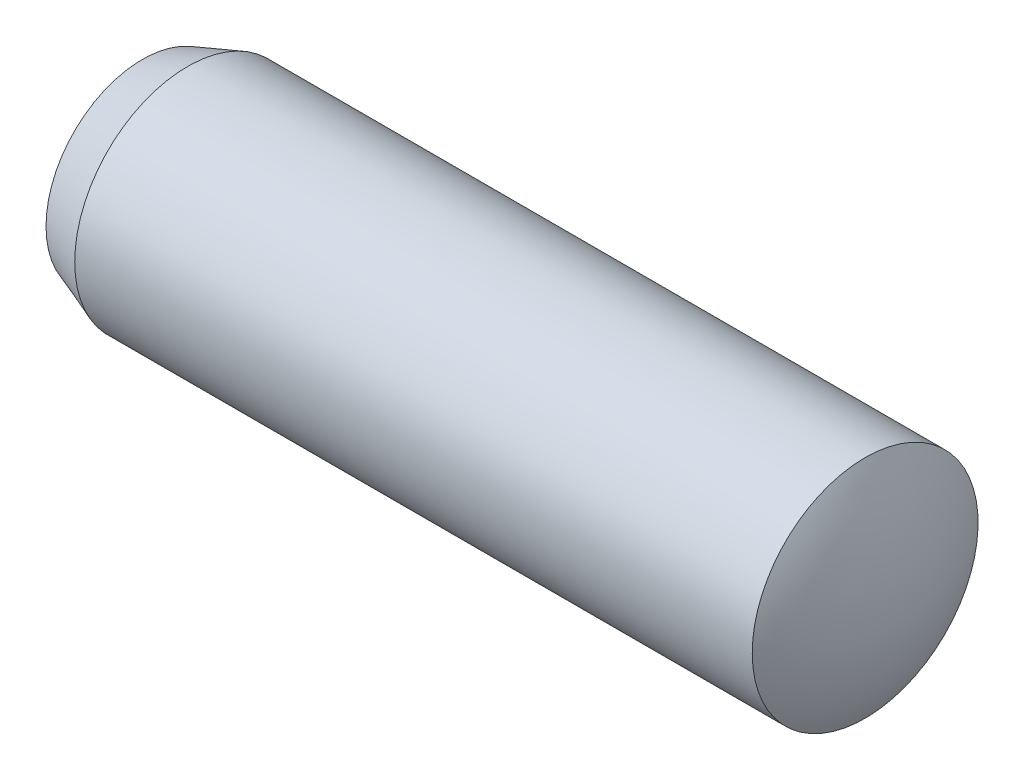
ISO-10303-21;
HEADER;
FILE_DESCRIPTION(('STEP AP214'),'2;1');
FILE_NAME('part.step','',(''),(''),'','','');
FILE_SCHEMA(('AUTOMOTIVE_DESIGN { 1 0 10303 214 1 1 1 1 }'));
ENDSEC;
DATA;
#1=APPLICATION_CONTEXT('core data for automotive mechanical design processes');
#2=APPLICATION_PROTOCOL_DEFINITION('international standard','automotive_design',2000,#1);
#3=PRODUCT_CONTEXT('',#1,'mechanical');
#4=PRODUCT('Part','Part','',(#3));
#5=PRODUCT_RELATED_PRODUCT_CATEGORY('part','',(#4));
#6=PRODUCT_DEFINITION_FORMATION('','',#4);
#7=PRODUCT_DEFINITION_CONTEXT('part definition',#1,'design');
#8=PRODUCT_DEFINITION('design','',#6,#7);
#9=PRODUCT_DEFINITION_SHAPE('','',#8);
#10=(LENGTH_UNIT() NAMED_UNIT(*) SI_UNIT(.MILLI.,.METRE.));
#11=(NAMED_UNIT(*) PLANE_ANGLE_UNIT() SI_UNIT($,.RADIAN.));
#12=(NAMED_UNIT(*) SI_UNIT($,.STERADIAN.) SOLID_ANGLE_UNIT());
#13=UNCERTAINTY_MEASURE_WITH_UNIT(LENGTH_MEASURE(1.E-05),#10,'distance_accuracy_value','');
#14=(GEOMETRIC_REPRESENTATION_CONTEXT(3) GLOBAL_UNCERTAINTY_ASSIGNED_CONTEXT((#13)) GLOBAL_UNIT_ASSIGNED_CONTEXT((#10,
#11,#12)) REPRESENTATION_CONTEXT('',''));
#15=CARTESIAN_POINT('',(0.,0.,0.));
#16=DIRECTION('',(0.,0.,1.));
#17=DIRECTION('',(1.,0.,0.));
#18=AXIS2_PLACEMENT_3D('',#15,#16,#17);
#19=CARTESIAN_POINT('',(0.,0.,0.));
#20=DIRECTION('',(-1.,0.,0.));
#21=DIRECTION('',(0.,0.,1.));
#22=AXIS2_PLACEMENT_3D('',#19,#20,#21);
#23=PLANE('',#22);
#24=CARTESIAN_POINT('',(0.,0.,0.));
#25=DIRECTION('',(-1.,0.,0.));
#26=DIRECTION('',(0.,0.,1.));
#27=AXIS2_PLACEMENT_3D('',#24,#25,#26);
#28=CIRCLE('',#27,2.56323571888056);
#29=CARTESIAN_POINT('',(0.,0.,2.56323571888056));
#30=VERTEX_POINT('',#29);
#31=EDGE_CURVE('E10',#30,#30,#28,.T.);
#32=ORIENTED_EDGE('',*,*,#31,.T.);
#33=EDGE_LOOP('',(#32));
#34=FACE_BOUND('',#33,.T.);
#35=ADVANCED_FACE('F27',(#34),#23,.T.);
#36=CARTESIAN_POINT('',(0.,0.,0.));
#37=DIRECTION('',(1.,0.,0.));
#38=DIRECTION('',(0.,0.,-1.));
#39=AXIS2_PLACEMENT_3D('',#36,#37,#38);
#40=CONICAL_SURFACE('',#39,2.56323571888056,0.349065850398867);
#41=CARTESIAN_POINT('',(1.20000000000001,0.,0.));
#42=DIRECTION('',(-1.,0.,0.));
#43=DIRECTION('',(0.,0.,1.));
#44=AXIS2_PLACEMENT_3D('',#41,#42,#43);
#45=CIRCLE('',#44,3.);
#46=CARTESIAN_POINT('',(1.20000000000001,0.,3.));
#47=VERTEX_POINT('',#46);
#48=EDGE_CURVE('E33',#47,#47,#45,.T.);
#49=ORIENTED_EDGE('',*,*,#48,.T.);
#50=EDGE_LOOP('',(#49));
#51=FACE_BOUND('',#50,.T.);
#52=ORIENTED_EDGE('',*,*,#31,.F.);
#53=EDGE_LOOP('',(#52));
#54=FACE_BOUND('',#53,.T.);
#55=ADVANCED_FACE('F53',(#51,#54),#40,.T.);
#56=CARTESIAN_POINT('',(0.,0.,0.));
#57=DIRECTION('',(-1.,0.,0.));
#58=DIRECTION('',(0.,0.,1.));
#59=AXIS2_PLACEMENT_3D('',#56,#57,#58);
#60=CYLINDRICAL_SURFACE('',#59,3.);
#61=CARTESIAN_POINT('',(19.2,0.,0.));
#62=DIRECTION('',(-1.,0.,0.));
#63=DIRECTION('',(0.,0.,1.));
#64=AXIS2_PLACEMENT_3D('',#61,#62,#63);
#65=CIRCLE('',#64,3.);
#66=CARTESIAN_POINT('',(19.2,0.,3.));
#67=VERTEX_POINT('',#66);
#68=EDGE_CURVE('E37',#67,#67,#65,.T.);
#69=ORIENTED_EDGE('',*,*,#68,.T.);
#70=EDGE_LOOP('',(#69));
#71=FACE_BOUND('',#70,.T.);
#72=ORIENTED_EDGE('',*,*,#48,.F.);
#73=EDGE_LOOP('',(#72));
#74=FACE_BOUND('',#73,.T.);
#75=ADVANCED_FACE('F44',(#71,#74),#60,.T.);
#76=CARTESIAN_POINT('',(13.975,0.,0.));
#77=DIRECTION('',(-1.,0.,0.));
#78=DIRECTION('',(0.,1.,0.));
#79=AXIS2_PLACEMENT_3D('',#76,#77,#78);
#80=SPHERICAL_SURFACE('',#79,6.02500000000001);
#81=ORIENTED_EDGE('',*,*,#68,.F.);
#82=EDGE_LOOP('',(#81));
#83=FACE_BOUND('',#82,.T.);
#84=ADVANCED_FACE('F47',(#83),#80,.T.);
#85=CLOSED_SHELL('',(#35,#55,#75,#84));
#86=MANIFOLD_SOLID_BREP('B2',#85);
#87=ADVANCED_BREP_SHAPE_REPRESENTATION('',(#18,#86),#14);
#88=SHAPE_DEFINITION_REPRESENTATION(#9,#87);
ENDSEC;
END-ISO-10303-21;
